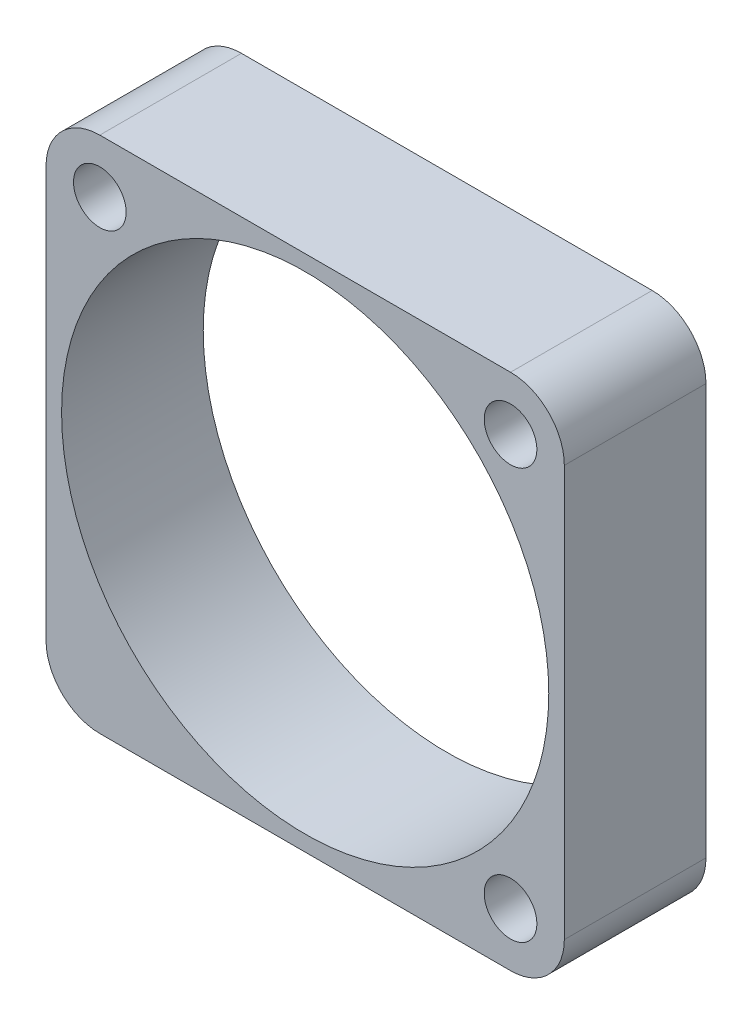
ISO-10303-21;
HEADER;
FILE_DESCRIPTION(('STEP AP214'),'2;1');
FILE_NAME('part.step','',(''),(''),'','','');
FILE_SCHEMA(('AUTOMOTIVE_DESIGN { 1 0 10303 214 1 1 1 1 }'));
ENDSEC;
DATA;
#1=APPLICATION_CONTEXT('core data for automotive mechanical design processes');
#2=APPLICATION_PROTOCOL_DEFINITION('international standard','automotive_design',2000,#1);
#3=PRODUCT_CONTEXT('',#1,'mechanical');
#4=PRODUCT('Part','Part','',(#3));
#5=PRODUCT_RELATED_PRODUCT_CATEGORY('part','',(#4));
#6=PRODUCT_DEFINITION_FORMATION('','',#4);
#7=PRODUCT_DEFINITION_CONTEXT('part definition',#1,'design');
#8=PRODUCT_DEFINITION('design','',#6,#7);
#9=PRODUCT_DEFINITION_SHAPE('','',#8);
#10=(LENGTH_UNIT() NAMED_UNIT(*) SI_UNIT(.MILLI.,.METRE.));
#11=(NAMED_UNIT(*) PLANE_ANGLE_UNIT() SI_UNIT($,.RADIAN.));
#12=(NAMED_UNIT(*) SI_UNIT($,.STERADIAN.) SOLID_ANGLE_UNIT());
#13=UNCERTAINTY_MEASURE_WITH_UNIT(LENGTH_MEASURE(1.E-05),#10,'distance_accuracy_value','');
#14=(GEOMETRIC_REPRESENTATION_CONTEXT(3) GLOBAL_UNCERTAINTY_ASSIGNED_CONTEXT((#13)) GLOBAL_UNIT_ASSIGNED_CONTEXT((#10,
#11,#12)) REPRESENTATION_CONTEXT('',''));
#15=CARTESIAN_POINT('',(0.,0.,0.));
#16=DIRECTION('',(0.,0.,1.));
#17=DIRECTION('',(1.,0.,0.));
#18=AXIS2_PLACEMENT_3D('',#15,#16,#17);
#19=CARTESIAN_POINT('',(0.,25.,6.8325));
#20=DIRECTION('',(0.,-1.,0.));
#21=DIRECTION('',(0.,0.,-1.));
#22=AXIS2_PLACEMENT_3D('',#19,#20,#21);
#23=PLANE('',#22);
#24=DIRECTION('',(0.,0.,1.));
#25=VECTOR('',#24,1.);
#26=CARTESIAN_POINT('',(2.5940000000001,24.9999999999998,0.));
#27=LINE('',#26,#25);
#28=CARTESIAN_POINT('',(2.5940000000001,25.,0.));
#29=VERTEX_POINT('',#28);
#30=CARTESIAN_POINT('',(2.5940000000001,24.9999999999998,6.8325));
#31=VERTEX_POINT('',#30);
#32=EDGE_CURVE('E50',#29,#31,#27,.T.);
#33=ORIENTED_EDGE('',*,*,#32,.T.);
#34=DIRECTION('',(-1.,0.,0.));
#35=VECTOR('',#34,1.);
#36=CARTESIAN_POINT('',(0.,25.,6.8325));
#37=LINE('',#36,#35);
#38=CARTESIAN_POINT('',(22.406,25.,6.8325));
#39=VERTEX_POINT('',#38);
#40=EDGE_CURVE('E11',#39,#31,#37,.T.);
#41=ORIENTED_EDGE('',*,*,#40,.F.);
#42=DIRECTION('',(0.,0.,1.));
#43=VECTOR('',#42,1.);
#44=CARTESIAN_POINT('',(22.406,25.,0.));
#45=LINE('',#44,#43);
#46=CARTESIAN_POINT('',(22.406,25.,0.));
#47=VERTEX_POINT('',#46);
#48=EDGE_CURVE('E153',#47,#39,#45,.T.);
#49=ORIENTED_EDGE('',*,*,#48,.F.);
#50=DIRECTION('',(-1.,0.,0.));
#51=VECTOR('',#50,1.);
#52=CARTESIAN_POINT('',(0.,25.,0.));
#53=LINE('',#52,#51);
#54=EDGE_CURVE('E37',#47,#29,#53,.T.);
#55=ORIENTED_EDGE('',*,*,#54,.T.);
#56=EDGE_LOOP('',(#33,#41,#49,#55));
#57=FACE_BOUND('',#56,.T.);
#58=ADVANCED_FACE('F33',(#57),#23,.F.);
#59=CARTESIAN_POINT('',(0.,0.,6.8325));
#60=DIRECTION('',(1.,0.,0.));
#61=DIRECTION('',(0.,0.,-1.));
#62=AXIS2_PLACEMENT_3D('',#59,#60,#61);
#63=PLANE('',#62);
#64=DIRECTION('',(0.,-1.,0.));
#65=VECTOR('',#64,1.);
#66=CARTESIAN_POINT('',(0.,0.,6.8325));
#67=LINE('',#66,#65);
#68=CARTESIAN_POINT('',(1.07552855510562E-13,22.4059999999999,6.8325));
#69=VERTEX_POINT('',#68);
#70=CARTESIAN_POINT('',(2.08166817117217E-13,2.59399999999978,6.8325));
#71=VERTEX_POINT('',#70);
#72=EDGE_CURVE('E109',#69,#71,#67,.T.);
#73=ORIENTED_EDGE('',*,*,#72,.F.);
#74=DIRECTION('',(0.,0.,1.));
#75=VECTOR('',#74,1.);
#76=CARTESIAN_POINT('',(1.07552855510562E-13,22.4059999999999,0.));
#77=LINE('',#76,#75);
#78=CARTESIAN_POINT('',(1.07552855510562E-13,22.4059999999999,0.));
#79=VERTEX_POINT('',#78);
#80=EDGE_CURVE('E101',#79,#69,#77,.T.);
#81=ORIENTED_EDGE('',*,*,#80,.F.);
#82=DIRECTION('',(0.,-1.,0.));
#83=VECTOR('',#82,1.);
#84=CARTESIAN_POINT('',(0.,0.,0.));
#85=LINE('',#84,#83);
#86=CARTESIAN_POINT('',(0.,2.59399999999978,0.));
#87=VERTEX_POINT('',#86);
#88=EDGE_CURVE('E58',#79,#87,#85,.T.);
#89=ORIENTED_EDGE('',*,*,#88,.T.);
#90=DIRECTION('',(0.,0.,1.));
#91=VECTOR('',#90,1.);
#92=CARTESIAN_POINT('',(2.08166817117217E-13,2.59399999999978,0.));
#93=LINE('',#92,#91);
#94=EDGE_CURVE('E229',#87,#71,#93,.T.);
#95=ORIENTED_EDGE('',*,*,#94,.T.);
#96=EDGE_LOOP('',(#73,#81,#89,#95));
#97=FACE_BOUND('',#96,.T.);
#98=ADVANCED_FACE('F35',(#97),#63,.F.);
#99=CARTESIAN_POINT('',(0.,0.,6.8325));
#100=DIRECTION('',(0.,1.,0.));
#101=DIRECTION('',(0.,0.,1.));
#102=AXIS2_PLACEMENT_3D('',#99,#100,#101);
#103=PLANE('',#102);
#104=DIRECTION('',(1.,0.,0.));
#105=VECTOR('',#104,1.);
#106=CARTESIAN_POINT('',(0.,0.,6.8325));
#107=LINE('',#106,#105);
#108=CARTESIAN_POINT('',(2.59400000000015,-2.04697370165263E-13,6.8325));
#109=VERTEX_POINT('',#108);
#110=CARTESIAN_POINT('',(22.4060000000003,0.,6.8325));
#111=VERTEX_POINT('',#110);
#112=EDGE_CURVE('E133',#109,#111,#107,.T.);
#113=ORIENTED_EDGE('',*,*,#112,.F.);
#114=DIRECTION('',(0.,0.,1.));
#115=VECTOR('',#114,1.);
#116=CARTESIAN_POINT('',(2.59400000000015,-2.04697370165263E-13,0.));
#117=LINE('',#116,#115);
#118=CARTESIAN_POINT('',(2.59400000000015,-2.04697370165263E-13,0.));
#119=VERTEX_POINT('',#118);
#120=EDGE_CURVE('E220',#119,#109,#117,.T.);
#121=ORIENTED_EDGE('',*,*,#120,.F.);
#122=DIRECTION('',(1.,0.,0.));
#123=VECTOR('',#122,1.);
#124=CARTESIAN_POINT('',(0.,0.,0.));
#125=LINE('',#124,#123);
#126=CARTESIAN_POINT('',(22.4060000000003,0.,0.));
#127=VERTEX_POINT('',#126);
#128=EDGE_CURVE('E117',#119,#127,#125,.T.);
#129=ORIENTED_EDGE('',*,*,#128,.T.);
#130=DIRECTION('',(0.,0.,1.));
#131=VECTOR('',#130,1.);
#132=CARTESIAN_POINT('',(22.4060000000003,0.,0.));
#133=LINE('',#132,#131);
#134=EDGE_CURVE('E222',#127,#111,#133,.T.);
#135=ORIENTED_EDGE('',*,*,#134,.T.);
#136=EDGE_LOOP('',(#113,#121,#129,#135));
#137=FACE_BOUND('',#136,.T.);
#138=ADVANCED_FACE('F210',(#137),#103,.F.);
#139=CARTESIAN_POINT('',(25.,0.,6.8325));
#140=DIRECTION('',(-1.,0.,0.));
#141=DIRECTION('',(0.,0.,1.));
#142=AXIS2_PLACEMENT_3D('',#139,#140,#141);
#143=PLANE('',#142);
#144=DIRECTION('',(0.,1.,0.));
#145=VECTOR('',#144,1.);
#146=CARTESIAN_POINT('',(25.,0.,6.8325));
#147=LINE('',#146,#145);
#148=CARTESIAN_POINT('',(25.0000000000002,2.59399999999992,6.8325));
#149=VERTEX_POINT('',#148);
#150=CARTESIAN_POINT('',(25.,22.406,6.8325));
#151=VERTEX_POINT('',#150);
#152=EDGE_CURVE('E42',#149,#151,#147,.T.);
#153=ORIENTED_EDGE('',*,*,#152,.F.);
#154=DIRECTION('',(0.,0.,1.));
#155=VECTOR('',#154,1.);
#156=CARTESIAN_POINT('',(25.0000000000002,2.59399999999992,0.));
#157=LINE('',#156,#155);
#158=CARTESIAN_POINT('',(25.0000000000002,2.59399999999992,0.));
#159=VERTEX_POINT('',#158);
#160=EDGE_CURVE('E155',#159,#149,#157,.T.);
#161=ORIENTED_EDGE('',*,*,#160,.F.);
#162=DIRECTION('',(0.,1.,0.));
#163=VECTOR('',#162,1.);
#164=CARTESIAN_POINT('',(25.,0.,0.));
#165=LINE('',#164,#163);
#166=CARTESIAN_POINT('',(25.,22.406,0.));
#167=VERTEX_POINT('',#166);
#168=EDGE_CURVE('E120',#159,#167,#165,.T.);
#169=ORIENTED_EDGE('',*,*,#168,.T.);
#170=DIRECTION('',(0.,0.,1.));
#171=VECTOR('',#170,1.);
#172=CARTESIAN_POINT('',(25.,22.406,0.));
#173=LINE('',#172,#171);
#174=EDGE_CURVE('E151',#167,#151,#173,.T.);
#175=ORIENTED_EDGE('',*,*,#174,.T.);
#176=EDGE_LOOP('',(#153,#161,#169,#175));
#177=FACE_BOUND('',#176,.T.);
#178=ADVANCED_FACE('F157',(#177),#143,.F.);
#179=CARTESIAN_POINT('',(0.,0.,6.8325));
#180=DIRECTION('',(0.,0.,-1.));
#181=DIRECTION('',(-1.,0.,0.));
#182=AXIS2_PLACEMENT_3D('',#179,#180,#181);
#183=PLANE('',#182);
#184=CARTESIAN_POINT('',(22.406,2.594,6.8325));
#185=DIRECTION('',(0.,0.,1.));
#186=DIRECTION('',(1.,0.,0.));
#187=AXIS2_PLACEMENT_3D('',#184,#185,#186);
#188=CIRCLE('',#187,1.26999999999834);
#189=CARTESIAN_POINT('',(23.6759999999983,2.594,6.8325));
#190=VERTEX_POINT('',#189);
#191=EDGE_CURVE('E159',#190,#190,#188,.T.);
#192=ORIENTED_EDGE('',*,*,#191,.F.);
#193=EDGE_LOOP('',(#192));
#194=FACE_BOUND('',#193,.T.);
#195=CARTESIAN_POINT('',(22.406,22.406,6.8325));
#196=DIRECTION('',(0.,0.,1.));
#197=DIRECTION('',(1.,0.,0.));
#198=AXIS2_PLACEMENT_3D('',#195,#196,#197);
#199=CIRCLE('',#198,1.26999999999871);
#200=CARTESIAN_POINT('',(23.6759999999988,22.406,6.8325));
#201=VERTEX_POINT('',#200);
#202=EDGE_CURVE('E166',#201,#201,#199,.T.);
#203=ORIENTED_EDGE('',*,*,#202,.F.);
#204=EDGE_LOOP('',(#203));
#205=FACE_BOUND('',#204,.T.);
#206=CARTESIAN_POINT('',(2.594,22.406,6.8325));
#207=DIRECTION('',(0.,0.,1.));
#208=DIRECTION('',(1.,0.,0.));
#209=AXIS2_PLACEMENT_3D('',#206,#207,#208);
#210=CIRCLE('',#209,1.27);
#211=CARTESIAN_POINT('',(3.864,22.406,6.8325));
#212=VERTEX_POINT('',#211);
#213=EDGE_CURVE('E172',#212,#212,#210,.T.);
#214=ORIENTED_EDGE('',*,*,#213,.F.);
#215=EDGE_LOOP('',(#214));
#216=FACE_BOUND('',#215,.T.);
#217=CARTESIAN_POINT('',(12.5,12.5,6.8325));
#218=DIRECTION('',(0.,0.,1.));
#219=DIRECTION('',(1.,0.,0.));
#220=AXIS2_PLACEMENT_3D('',#217,#218,#219);
#221=CIRCLE('',#220,11.75);
#222=CARTESIAN_POINT('',(24.25,12.5,6.8325));
#223=VERTEX_POINT('',#222);
#224=EDGE_CURVE('E123',#223,#223,#221,.T.);
#225=ORIENTED_EDGE('',*,*,#224,.F.);
#226=EDGE_LOOP('',(#225));
#227=FACE_BOUND('',#226,.T.);
#228=ORIENTED_EDGE('',*,*,#40,.T.);
#229=CARTESIAN_POINT('',(2.59400000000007,22.4059999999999,6.8325));
#230=DIRECTION('',(0.,0.,-1.));
#231=DIRECTION('',(-1.,0.,0.));
#232=AXIS2_PLACEMENT_3D('',#229,#230,#231);
#233=CIRCLE('',#232,2.59399999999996);
#234=EDGE_CURVE('E106',#69,#31,#233,.T.);
#235=ORIENTED_EDGE('',*,*,#234,.F.);
#236=ORIENTED_EDGE('',*,*,#72,.T.);
#237=CARTESIAN_POINT('',(2.59400000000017,2.59399999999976,6.8325));
#238=DIRECTION('',(0.,0.,-1.));
#239=DIRECTION('',(-1.,0.,0.));
#240=AXIS2_PLACEMENT_3D('',#237,#238,#239);
#241=CIRCLE('',#240,2.59399999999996);
#242=EDGE_CURVE('E110',#109,#71,#241,.T.);
#243=ORIENTED_EDGE('',*,*,#242,.F.);
#244=ORIENTED_EDGE('',*,*,#112,.T.);
#245=CARTESIAN_POINT('',(22.4060000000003,2.59399999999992,6.8325));
#246=DIRECTION('',(0.,0.,-1.));
#247=DIRECTION('',(-1.,0.,0.));
#248=AXIS2_PLACEMENT_3D('',#245,#246,#247);
#249=CIRCLE('',#248,2.59399999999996);
#250=EDGE_CURVE('E148',#149,#111,#249,.T.);
#251=ORIENTED_EDGE('',*,*,#250,.F.);
#252=ORIENTED_EDGE('',*,*,#152,.T.);
#253=CARTESIAN_POINT('',(22.406,22.406,6.8325));
#254=DIRECTION('',(0.,0.,-1.));
#255=DIRECTION('',(-1.,0.,0.));
#256=AXIS2_PLACEMENT_3D('',#253,#254,#255);
#257=CIRCLE('',#256,2.59399999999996);
#258=EDGE_CURVE('E145',#39,#151,#257,.T.);
#259=ORIENTED_EDGE('',*,*,#258,.F.);
#260=EDGE_LOOP('',(#228,#235,#236,#243,#244,#251,#252,#259));
#261=FACE_BOUND('',#260,.T.);
#262=ADVANCED_FACE('F144',(#194,#205,#216,#227,#261),#183,.F.);
#263=CARTESIAN_POINT('',(0.,0.,0.));
#264=DIRECTION('',(0.,0.,-1.));
#265=DIRECTION('',(-1.,0.,0.));
#266=AXIS2_PLACEMENT_3D('',#263,#264,#265);
#267=PLANE('',#266);
#268=CARTESIAN_POINT('',(2.59400000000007,22.4059999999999,0.));
#269=DIRECTION('',(0.,0.,-1.));
#270=DIRECTION('',(-1.,0.,0.));
#271=AXIS2_PLACEMENT_3D('',#268,#269,#270);
#272=CIRCLE('',#271,2.59399999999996);
#273=EDGE_CURVE('E99',#79,#29,#272,.T.);
#274=ORIENTED_EDGE('',*,*,#273,.T.);
#275=ORIENTED_EDGE('',*,*,#54,.F.);
#276=CARTESIAN_POINT('',(22.406,22.406,0.));
#277=DIRECTION('',(0.,0.,-1.));
#278=DIRECTION('',(-1.,0.,0.));
#279=AXIS2_PLACEMENT_3D('',#276,#277,#278);
#280=CIRCLE('',#279,2.59399999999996);
#281=EDGE_CURVE('E154',#47,#167,#280,.T.);
#282=ORIENTED_EDGE('',*,*,#281,.T.);
#283=ORIENTED_EDGE('',*,*,#168,.F.);
#284=CARTESIAN_POINT('',(22.4060000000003,2.59399999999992,0.));
#285=DIRECTION('',(0.,0.,-1.));
#286=DIRECTION('',(-1.,0.,0.));
#287=AXIS2_PLACEMENT_3D('',#284,#285,#286);
#288=CIRCLE('',#287,2.59399999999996);
#289=EDGE_CURVE('E226',#159,#127,#288,.T.);
#290=ORIENTED_EDGE('',*,*,#289,.T.);
#291=ORIENTED_EDGE('',*,*,#128,.F.);
#292=CARTESIAN_POINT('',(2.59400000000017,2.59399999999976,0.));
#293=DIRECTION('',(0.,0.,-1.));
#294=DIRECTION('',(-1.,0.,0.));
#295=AXIS2_PLACEMENT_3D('',#292,#293,#294);
#296=CIRCLE('',#295,2.59399999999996);
#297=EDGE_CURVE('E116',#119,#87,#296,.T.);
#298=ORIENTED_EDGE('',*,*,#297,.T.);
#299=ORIENTED_EDGE('',*,*,#88,.F.);
#300=EDGE_LOOP('',(#274,#275,#282,#283,#290,#291,#298,#299));
#301=FACE_BOUND('',#300,.T.);
#302=CARTESIAN_POINT('',(22.406,2.594,0.));
#303=DIRECTION('',(0.,0.,1.));
#304=DIRECTION('',(1.,0.,0.));
#305=AXIS2_PLACEMENT_3D('',#302,#303,#304);
#306=CIRCLE('',#305,1.26999999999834);
#307=CARTESIAN_POINT('',(23.6759999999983,2.594,0.));
#308=VERTEX_POINT('',#307);
#309=EDGE_CURVE('E163',#308,#308,#306,.T.);
#310=ORIENTED_EDGE('',*,*,#309,.T.);
#311=EDGE_LOOP('',(#310));
#312=FACE_BOUND('',#311,.T.);
#313=CARTESIAN_POINT('',(22.406,22.406,0.));
#314=DIRECTION('',(0.,0.,1.));
#315=DIRECTION('',(1.,0.,0.));
#316=AXIS2_PLACEMENT_3D('',#313,#314,#315);
#317=CIRCLE('',#316,1.26999999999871);
#318=CARTESIAN_POINT('',(23.6759999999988,22.406,0.));
#319=VERTEX_POINT('',#318);
#320=EDGE_CURVE('E169',#319,#319,#317,.T.);
#321=ORIENTED_EDGE('',*,*,#320,.T.);
#322=EDGE_LOOP('',(#321));
#323=FACE_BOUND('',#322,.T.);
#324=CARTESIAN_POINT('',(2.594,22.406,0.));
#325=DIRECTION('',(0.,0.,1.));
#326=DIRECTION('',(1.,0.,0.));
#327=AXIS2_PLACEMENT_3D('',#324,#325,#326);
#328=CIRCLE('',#327,1.27);
#329=CARTESIAN_POINT('',(3.864,22.406,0.));
#330=VERTEX_POINT('',#329);
#331=EDGE_CURVE('E175',#330,#330,#328,.T.);
#332=ORIENTED_EDGE('',*,*,#331,.T.);
#333=EDGE_LOOP('',(#332));
#334=FACE_BOUND('',#333,.T.);
#335=CARTESIAN_POINT('',(12.5,12.5,0.));
#336=DIRECTION('',(0.,0.,1.));
#337=DIRECTION('',(1.,0.,0.));
#338=AXIS2_PLACEMENT_3D('',#335,#336,#337);
#339=CIRCLE('',#338,11.75);
#340=CARTESIAN_POINT('',(24.25,12.5,0.));
#341=VERTEX_POINT('',#340);
#342=EDGE_CURVE('E118',#341,#341,#339,.T.);
#343=ORIENTED_EDGE('',*,*,#342,.T.);
#344=EDGE_LOOP('',(#343));
#345=FACE_BOUND('',#344,.T.);
#346=ADVANCED_FACE('F113',(#301,#312,#323,#334,#345),#267,.T.);
#347=CARTESIAN_POINT('',(12.5,12.5,0.));
#348=DIRECTION('',(0.,0.,1.));
#349=DIRECTION('',(1.,0.,0.));
#350=AXIS2_PLACEMENT_3D('',#347,#348,#349);
#351=CYLINDRICAL_SURFACE('',#350,11.75);
#352=ORIENTED_EDGE('',*,*,#342,.F.);
#353=EDGE_LOOP('',(#352));
#354=FACE_BOUND('',#353,.T.);
#355=ORIENTED_EDGE('',*,*,#224,.T.);
#356=EDGE_LOOP('',(#355));
#357=FACE_BOUND('',#356,.T.);
#358=ADVANCED_FACE('F190',(#354,#357),#351,.F.);
#359=CARTESIAN_POINT('',(2.594,22.406,0.));
#360=DIRECTION('',(0.,0.,1.));
#361=DIRECTION('',(1.,0.,0.));
#362=AXIS2_PLACEMENT_3D('',#359,#360,#361);
#363=CYLINDRICAL_SURFACE('',#362,1.27);
#364=ORIENTED_EDGE('',*,*,#331,.F.);
#365=EDGE_LOOP('',(#364));
#366=FACE_BOUND('',#365,.T.);
#367=ORIENTED_EDGE('',*,*,#213,.T.);
#368=EDGE_LOOP('',(#367));
#369=FACE_BOUND('',#368,.T.);
#370=ADVANCED_FACE('F181',(#366,#369),#363,.F.);
#371=CARTESIAN_POINT('',(22.406,22.406,0.));
#372=DIRECTION('',(0.,0.,1.));
#373=DIRECTION('',(1.,0.,0.));
#374=AXIS2_PLACEMENT_3D('',#371,#372,#373);
#375=CYLINDRICAL_SURFACE('',#374,1.26999999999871);
#376=ORIENTED_EDGE('',*,*,#320,.F.);
#377=EDGE_LOOP('',(#376));
#378=FACE_BOUND('',#377,.T.);
#379=ORIENTED_EDGE('',*,*,#202,.T.);
#380=EDGE_LOOP('',(#379));
#381=FACE_BOUND('',#380,.T.);
#382=ADVANCED_FACE('F198',(#378,#381),#375,.F.);
#383=CARTESIAN_POINT('',(22.406,2.594,0.));
#384=DIRECTION('',(0.,0.,1.));
#385=DIRECTION('',(1.,0.,0.));
#386=AXIS2_PLACEMENT_3D('',#383,#384,#385);
#387=CYLINDRICAL_SURFACE('',#386,1.26999999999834);
#388=ORIENTED_EDGE('',*,*,#309,.F.);
#389=EDGE_LOOP('',(#388));
#390=FACE_BOUND('',#389,.T.);
#391=ORIENTED_EDGE('',*,*,#191,.T.);
#392=EDGE_LOOP('',(#391));
#393=FACE_BOUND('',#392,.T.);
#394=ADVANCED_FACE('F251',(#390,#393),#387,.F.);
#395=CARTESIAN_POINT('',(22.406,22.406,0.));
#396=DIRECTION('',(0.,0.,1.));
#397=DIRECTION('',(1.,0.,0.));
#398=AXIS2_PLACEMENT_3D('',#395,#396,#397);
#399=CYLINDRICAL_SURFACE('',#398,2.59399999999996);
#400=ORIENTED_EDGE('',*,*,#258,.T.);
#401=ORIENTED_EDGE('',*,*,#174,.F.);
#402=ORIENTED_EDGE('',*,*,#281,.F.);
#403=ORIENTED_EDGE('',*,*,#48,.T.);
#404=EDGE_LOOP('',(#400,#401,#402,#403));
#405=FACE_BOUND('',#404,.T.);
#406=ADVANCED_FACE('F150',(#405),#399,.T.);
#407=CARTESIAN_POINT('',(22.4060000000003,2.59399999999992,0.));
#408=DIRECTION('',(0.,0.,1.));
#409=DIRECTION('',(1.,0.,0.));
#410=AXIS2_PLACEMENT_3D('',#407,#408,#409);
#411=CYLINDRICAL_SURFACE('',#410,2.59399999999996);
#412=ORIENTED_EDGE('',*,*,#250,.T.);
#413=ORIENTED_EDGE('',*,*,#134,.F.);
#414=ORIENTED_EDGE('',*,*,#289,.F.);
#415=ORIENTED_EDGE('',*,*,#160,.T.);
#416=EDGE_LOOP('',(#412,#413,#414,#415));
#417=FACE_BOUND('',#416,.T.);
#418=ADVANCED_FACE('F224',(#417),#411,.T.);
#419=CARTESIAN_POINT('',(2.59400000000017,2.59399999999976,0.));
#420=DIRECTION('',(0.,0.,1.));
#421=DIRECTION('',(1.,0.,0.));
#422=AXIS2_PLACEMENT_3D('',#419,#420,#421);
#423=CYLINDRICAL_SURFACE('',#422,2.59399999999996);
#424=ORIENTED_EDGE('',*,*,#242,.T.);
#425=ORIENTED_EDGE('',*,*,#94,.F.);
#426=ORIENTED_EDGE('',*,*,#297,.F.);
#427=ORIENTED_EDGE('',*,*,#120,.T.);
#428=EDGE_LOOP('',(#424,#425,#426,#427));
#429=FACE_BOUND('',#428,.T.);
#430=ADVANCED_FACE('F239',(#429),#423,.T.);
#431=CARTESIAN_POINT('',(2.59400000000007,22.4059999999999,0.));
#432=DIRECTION('',(0.,0.,1.));
#433=DIRECTION('',(1.,0.,0.));
#434=AXIS2_PLACEMENT_3D('',#431,#432,#433);
#435=CYLINDRICAL_SURFACE('',#434,2.59399999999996);
#436=ORIENTED_EDGE('',*,*,#234,.T.);
#437=ORIENTED_EDGE('',*,*,#32,.F.);
#438=ORIENTED_EDGE('',*,*,#273,.F.);
#439=ORIENTED_EDGE('',*,*,#80,.T.);
#440=EDGE_LOOP('',(#436,#437,#438,#439));
#441=FACE_BOUND('',#440,.T.);
#442=ADVANCED_FACE('F100',(#441),#435,.T.);
#443=CLOSED_SHELL('',(#58,#98,#138,#178,#262,#346,#358,#370,#382,#394,#406,#418,#430,#442));
#444=MANIFOLD_SOLID_BREP('B2',#443);
#445=ADVANCED_BREP_SHAPE_REPRESENTATION('',(#18,#444),#14);
#446=SHAPE_DEFINITION_REPRESENTATION(#9,#445);
ENDSEC;
END-ISO-10303-21;
